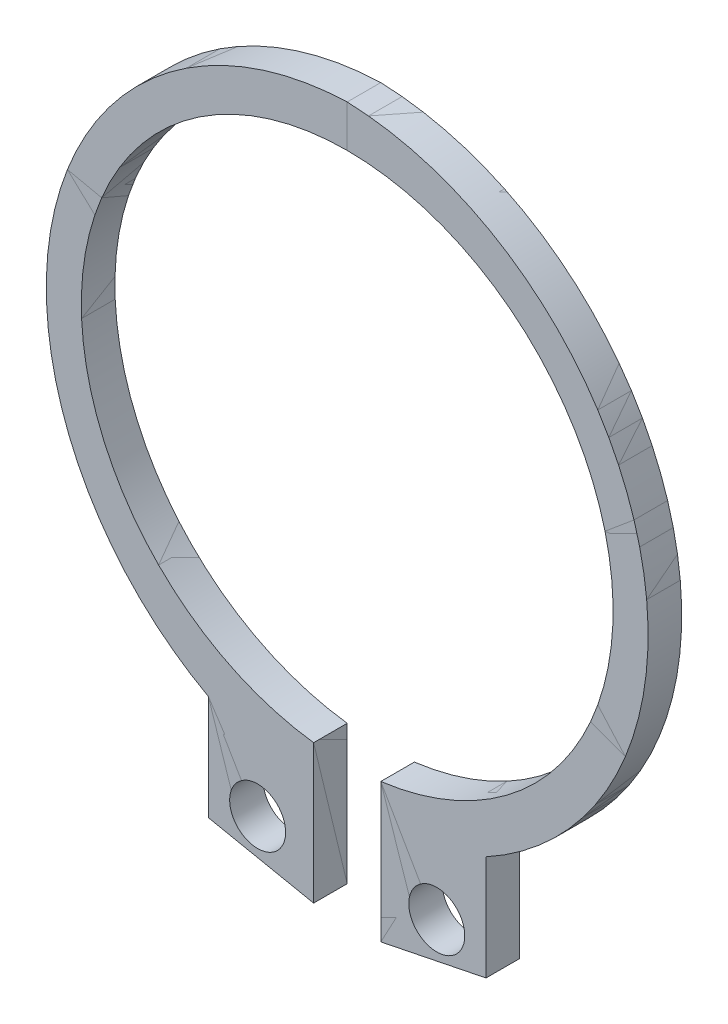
ISO-10303-21;
HEADER;
FILE_DESCRIPTION(('STEP AP214'),'2;1');
FILE_NAME('part.step','',(''),(''),'','','');
FILE_SCHEMA(('AUTOMOTIVE_DESIGN { 1 0 10303 214 1 1 1 1 }'));
ENDSEC;
DATA;
#1=APPLICATION_CONTEXT('core data for automotive mechanical design processes');
#2=APPLICATION_PROTOCOL_DEFINITION('international standard','automotive_design',2000,#1);
#3=PRODUCT_CONTEXT('',#1,'mechanical');
#4=PRODUCT('Part','Part','',(#3));
#5=PRODUCT_RELATED_PRODUCT_CATEGORY('part','',(#4));
#6=PRODUCT_DEFINITION_FORMATION('','',#4);
#7=PRODUCT_DEFINITION_CONTEXT('part definition',#1,'design');
#8=PRODUCT_DEFINITION('design','',#6,#7);
#9=PRODUCT_DEFINITION_SHAPE('','',#8);
#10=(LENGTH_UNIT() NAMED_UNIT(*) SI_UNIT(.MILLI.,.METRE.));
#11=(NAMED_UNIT(*) PLANE_ANGLE_UNIT() SI_UNIT($,.RADIAN.));
#12=(NAMED_UNIT(*) SI_UNIT($,.STERADIAN.) SOLID_ANGLE_UNIT());
#13=UNCERTAINTY_MEASURE_WITH_UNIT(LENGTH_MEASURE(1.E-05),#10,'distance_accuracy_value','');
#14=(GEOMETRIC_REPRESENTATION_CONTEXT(3) GLOBAL_UNCERTAINTY_ASSIGNED_CONTEXT((#13)) GLOBAL_UNIT_ASSIGNED_CONTEXT((#10,
#11,#12)) REPRESENTATION_CONTEXT('',''));
#15=CARTESIAN_POINT('',(0.,0.,0.));
#16=DIRECTION('',(0.,0.,1.));
#17=DIRECTION('',(1.,0.,0.));
#18=AXIS2_PLACEMENT_3D('',#15,#16,#17);
#19=CARTESIAN_POINT('',(-4.95929207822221,-13.6255430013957,1.2));
#20=DIRECTION('',(0.198862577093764,0.980027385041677,0.));
#21=DIRECTION('',(-0.980027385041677,0.198862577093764,0.));
#22=AXIS2_PLACEMENT_3D('',#19,#20,#21);
#23=PLANE('',#22);
#24=DIRECTION('',(0.980027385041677,-0.198862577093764,0.));
#25=VECTOR('',#24,1.);
#26=CARTESIAN_POINT('',(-4.95929207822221,-13.6255430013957,0.));
#27=LINE('',#26,#25);
#28=CARTESIAN_POINT('',(-4.95929207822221,-13.6255430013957,0.));
#29=VERTEX_POINT('',#28);
#30=CARTESIAN_POINT('',(-1.20000000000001,-14.3883609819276,0.));
#31=VERTEX_POINT('',#30);
#32=EDGE_CURVE('P0_E464',#29,#31,#27,.T.);
#33=ORIENTED_EDGE('',*,*,#32,.T.);
#34=DIRECTION('',(0.,0.,1.));
#35=VECTOR('',#34,1.);
#36=CARTESIAN_POINT('',(-1.20000000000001,-14.3883609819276,1.2));
#37=LINE('',#36,#35);
#38=CARTESIAN_POINT('',(-1.20000000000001,-14.3883609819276,1.2));
#39=VERTEX_POINT('',#38);
#40=EDGE_CURVE('P0_E369',#31,#39,#37,.T.);
#41=ORIENTED_EDGE('',*,*,#40,.T.);
#42=DIRECTION('',(0.980027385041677,-0.198862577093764,0.));
#43=VECTOR('',#42,1.);
#44=CARTESIAN_POINT('',(-4.95929207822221,-13.6255430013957,1.2));
#45=LINE('',#44,#43);
#46=CARTESIAN_POINT('',(-4.95929207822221,-13.6255430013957,1.2));
#47=VERTEX_POINT('',#46);
#48=EDGE_CURVE('P0_E470',#47,#39,#45,.T.);
#49=ORIENTED_EDGE('',*,*,#48,.F.);
#50=DIRECTION('',(0.,0.,-1.));
#51=VECTOR('',#50,1.);
#52=CARTESIAN_POINT('',(-4.95929207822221,-13.6255430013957,1.2));
#53=LINE('',#52,#51);
#54=EDGE_CURVE('P0_E356',#47,#29,#53,.T.);
#55=ORIENTED_EDGE('',*,*,#54,.T.);
#56=EDGE_LOOP('',(#33,#41,#49,#55));
#57=FACE_BOUND('',#56,.T.);
#58=ADVANCED_FACE('P0_F353',(#57),#23,.F.);
#59=CARTESIAN_POINT('',(0.,0.,1.2));
#60=DIRECTION('',(0.,0.,-1.));
#61=DIRECTION('',(-1.,0.,0.));
#62=AXIS2_PLACEMENT_3D('',#59,#60,#61);
#63=CYLINDRICAL_SURFACE('',#62,9.5);
#64=DIRECTION('',(0.,0.,-1.));
#65=VECTOR('',#64,1.);
#66=CARTESIAN_POINT('',(-1.20000000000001,-9.42390577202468,1.2));
#67=LINE('',#66,#65);
#68=CARTESIAN_POINT('',(-1.20000000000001,-9.42390577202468,0.));
#69=VERTEX_POINT('',#68);
#70=CARTESIAN_POINT('',(-1.20000000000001,-9.42390577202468,1.2));
#71=VERTEX_POINT('',#70);
#72=EDGE_CURVE('P0_E447',#69,#71,#67,.F.);
#73=ORIENTED_EDGE('',*,*,#72,.F.);
#74=CARTESIAN_POINT('',(0.,0.,0.));
#75=DIRECTION('',(0.,0.,1.));
#76=DIRECTION('',(0.,1.,0.));
#77=AXIS2_PLACEMENT_3D('',#74,#75,#76);
#78=CIRCLE('',#77,9.5);
#79=CARTESIAN_POINT('',(0.,9.5,0.));
#80=VERTEX_POINT('',#79);
#81=EDGE_CURVE('P0_E477',#80,#69,#78,.T.);
#82=ORIENTED_EDGE('',*,*,#81,.F.);
#83=DIRECTION('',(0.,0.,-1.));
#84=VECTOR('',#83,1.);
#85=CARTESIAN_POINT('',(0.,9.5,1.2));
#86=LINE('',#85,#84);
#87=CARTESIAN_POINT('',(0.,9.5,1.2));
#88=VERTEX_POINT('',#87);
#89=EDGE_CURVE('P0_E11',#88,#80,#86,.T.);
#90=ORIENTED_EDGE('',*,*,#89,.F.);
#91=CARTESIAN_POINT('',(0.,0.,1.2));
#92=DIRECTION('',(0.,0.,1.));
#93=DIRECTION('',(0.,1.,0.));
#94=AXIS2_PLACEMENT_3D('',#91,#92,#93);
#95=CIRCLE('',#94,9.5);
#96=EDGE_CURVE('P0_E490',#88,#71,#95,.T.);
#97=ORIENTED_EDGE('',*,*,#96,.T.);
#98=EDGE_LOOP('',(#73,#82,#90,#97));
#99=FACE_BOUND('',#98,.T.);
#100=ADVANCED_FACE('P0_F518',(#99),#63,.F.);
#101=CARTESIAN_POINT('',(0.370425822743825,-0.114847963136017,1.2));
#102=DIRECTION('',(0.,0.,-1.));
#103=DIRECTION('',(-1.,0.,0.));
#104=AXIS2_PLACEMENT_3D('',#101,#102,#103);
#105=CYLINDRICAL_SURFACE('',#104,11.1210188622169);
#106=CARTESIAN_POINT('',(0.370425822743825,-0.114847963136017,0.));
#107=DIRECTION('',(0.,0.,1.));
#108=DIRECTION('',(0.,1.,0.));
#109=AXIS2_PLACEMENT_3D('',#106,#107,#108);
#110=CIRCLE('',#109,11.1210188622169);
#111=CARTESIAN_POINT('',(0.,11.,0.));
#112=VERTEX_POINT('',#111);
#113=CARTESIAN_POINT('',(-4.95929207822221,-9.87554300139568,0.));
#114=VERTEX_POINT('',#113);
#115=EDGE_CURVE('P0_E471',#112,#114,#110,.T.);
#116=ORIENTED_EDGE('',*,*,#115,.T.);
#117=DIRECTION('',(0.,0.,-1.));
#118=VECTOR('',#117,1.);
#119=CARTESIAN_POINT('',(-4.95929207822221,-9.87554300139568,1.2));
#120=LINE('',#119,#118);
#121=CARTESIAN_POINT('',(-4.95929207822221,-9.87554300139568,1.2));
#122=VERTEX_POINT('',#121);
#123=EDGE_CURVE('P0_E496',#122,#114,#120,.T.);
#124=ORIENTED_EDGE('',*,*,#123,.F.);
#125=CARTESIAN_POINT('',(0.370425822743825,-0.114847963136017,1.2));
#126=DIRECTION('',(0.,0.,1.));
#127=DIRECTION('',(0.,1.,0.));
#128=AXIS2_PLACEMENT_3D('',#125,#126,#127);
#129=CIRCLE('',#128,11.1210188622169);
#130=CARTESIAN_POINT('',(0.,11.,1.2));
#131=VERTEX_POINT('',#130);
#132=EDGE_CURVE('P0_E485',#131,#122,#129,.T.);
#133=ORIENTED_EDGE('',*,*,#132,.F.);
#134=DIRECTION('',(0.,0.,-1.));
#135=VECTOR('',#134,1.);
#136=CARTESIAN_POINT('',(0.,11.,1.2));
#137=LINE('',#136,#135);
#138=EDGE_CURVE('P0_E361',#131,#112,#137,.T.);
#139=ORIENTED_EDGE('',*,*,#138,.T.);
#140=EDGE_LOOP('',(#116,#124,#133,#139));
#141=FACE_BOUND('',#140,.T.);
#142=ADVANCED_FACE('P0_F510',(#141),#105,.T.);
#143=CARTESIAN_POINT('',(-4.95929207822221,-13.6255430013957,1.2));
#144=DIRECTION('',(-1.,0.,0.));
#145=DIRECTION('',(0.,0.,1.));
#146=AXIS2_PLACEMENT_3D('',#143,#144,#145);
#147=PLANE('',#146);
#148=DIRECTION('',(0.,1.,0.));
#149=VECTOR('',#148,1.);
#150=CARTESIAN_POINT('',(-4.95929207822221,-13.6255430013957,0.));
#151=LINE('',#150,#149);
#152=EDGE_CURVE('P0_E467',#29,#114,#151,.T.);
#153=ORIENTED_EDGE('',*,*,#152,.F.);
#154=ORIENTED_EDGE('',*,*,#54,.F.);
#155=DIRECTION('',(0.,1.,0.));
#156=VECTOR('',#155,1.);
#157=CARTESIAN_POINT('',(-4.95929207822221,-13.6255430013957,1.2));
#158=LINE('',#157,#156);
#159=EDGE_CURVE('P0_E482',#47,#122,#158,.T.);
#160=ORIENTED_EDGE('',*,*,#159,.T.);
#161=ORIENTED_EDGE('',*,*,#123,.T.);
#162=EDGE_LOOP('',(#153,#154,#160,#161));
#163=FACE_BOUND('',#162,.T.);
#164=ADVANCED_FACE('P0_F507',(#163),#147,.T.);
#165=CARTESIAN_POINT('',(0.,0.,1.2));
#166=DIRECTION('',(0.,0.,1.));
#167=DIRECTION('',(1.,0.,0.));
#168=AXIS2_PLACEMENT_3D('',#165,#166,#167);
#169=PLANE('',#168);
#170=CARTESIAN_POINT('',(-3.20000000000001,-12.7,1.2));
#171=DIRECTION('',(0.,0.,-1.));
#172=DIRECTION('',(0.,1.,0.));
#173=AXIS2_PLACEMENT_3D('',#170,#171,#172);
#174=CIRCLE('',#173,1.);
#175=CARTESIAN_POINT('',(-3.20000000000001,-11.7,1.2));
#176=VERTEX_POINT('',#175);
#177=EDGE_CURVE('P0_E597',#176,#176,#174,.T.);
#178=ORIENTED_EDGE('',*,*,#177,.T.);
#179=EDGE_LOOP('',(#178));
#180=FACE_BOUND('',#179,.T.);
#181=DIRECTION('',(0.,1.,0.));
#182=VECTOR('',#181,1.);
#183=CARTESIAN_POINT('',(-1.20000000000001,-8.45,1.2));
#184=LINE('',#183,#182);
#185=EDGE_CURVE('P0_E554',#39,#71,#184,.T.);
#186=ORIENTED_EDGE('',*,*,#185,.T.);
#187=ORIENTED_EDGE('',*,*,#96,.F.);
#188=DIRECTION('',(0.,-1.,0.));
#189=VECTOR('',#188,1.);
#190=CARTESIAN_POINT('',(0.,11.,1.2));
#191=LINE('',#190,#189);
#192=EDGE_CURVE('P0_E487',#131,#88,#191,.T.);
#193=ORIENTED_EDGE('',*,*,#192,.F.);
#194=ORIENTED_EDGE('',*,*,#132,.T.);
#195=ORIENTED_EDGE('',*,*,#159,.F.);
#196=ORIENTED_EDGE('',*,*,#48,.T.);
#197=EDGE_LOOP('',(#186,#187,#193,#194,#195,#196));
#198=FACE_BOUND('',#197,.T.);
#199=ADVANCED_FACE('P0_F509',(#180,#198),#169,.T.);
#200=CARTESIAN_POINT('',(0.,0.,0.));
#201=DIRECTION('',(0.,0.,1.));
#202=DIRECTION('',(1.,0.,0.));
#203=AXIS2_PLACEMENT_3D('',#200,#201,#202);
#204=PLANE('',#203);
#205=CARTESIAN_POINT('',(-3.20000000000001,-12.7,0.));
#206=DIRECTION('',(0.,0.,1.));
#207=DIRECTION('',(0.,1.,0.));
#208=AXIS2_PLACEMENT_3D('',#205,#206,#207);
#209=CIRCLE('',#208,1.);
#210=CARTESIAN_POINT('',(-3.20000000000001,-11.7,0.));
#211=VERTEX_POINT('',#210);
#212=EDGE_CURVE('P0_E595',#211,#211,#209,.T.);
#213=ORIENTED_EDGE('',*,*,#212,.T.);
#214=EDGE_LOOP('',(#213));
#215=FACE_BOUND('',#214,.T.);
#216=ORIENTED_EDGE('',*,*,#81,.T.);
#217=DIRECTION('',(0.,-1.,0.));
#218=VECTOR('',#217,1.);
#219=CARTESIAN_POINT('',(-1.20000000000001,-8.45,0.));
#220=LINE('',#219,#218);
#221=EDGE_CURVE('P0_E437',#69,#31,#220,.T.);
#222=ORIENTED_EDGE('',*,*,#221,.T.);
#223=ORIENTED_EDGE('',*,*,#32,.F.);
#224=ORIENTED_EDGE('',*,*,#152,.T.);
#225=ORIENTED_EDGE('',*,*,#115,.F.);
#226=DIRECTION('',(0.,-1.,0.));
#227=VECTOR('',#226,1.);
#228=CARTESIAN_POINT('',(0.,11.,0.));
#229=LINE('',#228,#227);
#230=EDGE_CURVE('P0_E474',#112,#80,#229,.T.);
#231=ORIENTED_EDGE('',*,*,#230,.T.);
#232=EDGE_LOOP('',(#216,#222,#223,#224,#225,#231));
#233=FACE_BOUND('',#232,.T.);
#234=ADVANCED_FACE('P0_F505',(#215,#233),#204,.F.);
#235=CARTESIAN_POINT('',(4.95929207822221,-13.6255430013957,0.));
#236=DIRECTION('',(-0.198862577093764,0.980027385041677,0.));
#237=DIRECTION('',(0.980027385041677,0.198862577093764,0.));
#238=AXIS2_PLACEMENT_3D('',#235,#236,#237);
#239=PLANE('',#238);
#240=DIRECTION('',(-0.980027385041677,-0.198862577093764,0.));
#241=VECTOR('',#240,1.);
#242=CARTESIAN_POINT('',(4.95929207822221,-13.6255430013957,1.2));
#243=LINE('',#242,#241);
#244=CARTESIAN_POINT('',(4.95929207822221,-13.6255430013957,1.2));
#245=VERTEX_POINT('',#244);
#246=CARTESIAN_POINT('',(1.20000000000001,-14.3883609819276,1.2));
#247=VERTEX_POINT('',#246);
#248=EDGE_CURVE('P0_E446',#245,#247,#243,.T.);
#249=ORIENTED_EDGE('',*,*,#248,.T.);
#250=DIRECTION('',(0.,0.,-1.));
#251=VECTOR('',#250,1.);
#252=CARTESIAN_POINT('',(1.20000000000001,-14.3883609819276,0.));
#253=LINE('',#252,#251);
#254=CARTESIAN_POINT('',(1.20000000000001,-14.3883609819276,0.));
#255=VERTEX_POINT('',#254);
#256=EDGE_CURVE('P0_E377',#247,#255,#253,.T.);
#257=ORIENTED_EDGE('',*,*,#256,.T.);
#258=DIRECTION('',(-0.980027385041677,-0.198862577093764,0.));
#259=VECTOR('',#258,1.);
#260=CARTESIAN_POINT('',(4.95929207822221,-13.6255430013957,0.));
#261=LINE('',#260,#259);
#262=CARTESIAN_POINT('',(4.95929207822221,-13.6255430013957,0.));
#263=VERTEX_POINT('',#262);
#264=EDGE_CURVE('P0_E443',#263,#255,#261,.T.);
#265=ORIENTED_EDGE('',*,*,#264,.F.);
#266=DIRECTION('',(0.,0.,1.));
#267=VECTOR('',#266,1.);
#268=CARTESIAN_POINT('',(4.95929207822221,-13.6255430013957,0.));
#269=LINE('',#268,#267);
#270=EDGE_CURVE('P0_E465',#263,#245,#269,.T.);
#271=ORIENTED_EDGE('',*,*,#270,.T.);
#272=EDGE_LOOP('',(#249,#257,#265,#271));
#273=FACE_BOUND('',#272,.T.);
#274=ADVANCED_FACE('P0_F442',(#273),#239,.F.);
#275=CARTESIAN_POINT('',(0.,0.,0.));
#276=DIRECTION('',(0.,0.,1.));
#277=DIRECTION('',(1.,0.,0.));
#278=AXIS2_PLACEMENT_3D('',#275,#276,#277);
#279=CYLINDRICAL_SURFACE('',#278,9.5);
#280=DIRECTION('',(0.,0.,1.));
#281=VECTOR('',#280,1.);
#282=CARTESIAN_POINT('',(1.20000000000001,-9.42390577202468,0.));
#283=LINE('',#282,#281);
#284=CARTESIAN_POINT('',(1.20000000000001,-9.42390577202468,1.2));
#285=VERTEX_POINT('',#284);
#286=CARTESIAN_POINT('',(1.20000000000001,-9.42390577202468,0.));
#287=VERTEX_POINT('',#286);
#288=EDGE_CURVE('P0_E432',#285,#287,#283,.F.);
#289=ORIENTED_EDGE('',*,*,#288,.F.);
#290=CARTESIAN_POINT('',(0.,0.,1.2));
#291=DIRECTION('',(0.,0.,-1.));
#292=DIRECTION('',(0.,1.,0.));
#293=AXIS2_PLACEMENT_3D('',#290,#291,#292);
#294=CIRCLE('',#293,9.5);
#295=EDGE_CURVE('P0_E546',#88,#285,#294,.T.);
#296=ORIENTED_EDGE('',*,*,#295,.F.);
#297=ORIENTED_EDGE('',*,*,#89,.T.);
#298=CARTESIAN_POINT('',(0.,0.,0.));
#299=DIRECTION('',(0.,0.,-1.));
#300=DIRECTION('',(0.,1.,0.));
#301=AXIS2_PLACEMENT_3D('',#298,#299,#300);
#302=CIRCLE('',#301,9.5);
#303=EDGE_CURVE('P0_E452',#80,#287,#302,.T.);
#304=ORIENTED_EDGE('',*,*,#303,.T.);
#305=EDGE_LOOP('',(#289,#296,#297,#304));
#306=FACE_BOUND('',#305,.T.);
#307=ADVANCED_FACE('P0_F583',(#306),#279,.F.);
#308=CARTESIAN_POINT('',(-0.370425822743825,-0.114847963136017,0.));
#309=DIRECTION('',(0.,0.,1.));
#310=DIRECTION('',(1.,0.,0.));
#311=AXIS2_PLACEMENT_3D('',#308,#309,#310);
#312=CYLINDRICAL_SURFACE('',#311,11.1210188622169);
#313=CARTESIAN_POINT('',(-0.370425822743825,-0.114847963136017,1.2));
#314=DIRECTION('',(0.,0.,-1.));
#315=DIRECTION('',(0.,1.,0.));
#316=AXIS2_PLACEMENT_3D('',#313,#314,#315);
#317=CIRCLE('',#316,11.1210188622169);
#318=CARTESIAN_POINT('',(4.95929207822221,-9.87554300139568,1.2));
#319=VERTEX_POINT('',#318);
#320=EDGE_CURVE('P0_E458',#131,#319,#317,.T.);
#321=ORIENTED_EDGE('',*,*,#320,.T.);
#322=DIRECTION('',(0.,0.,1.));
#323=VECTOR('',#322,1.);
#324=CARTESIAN_POINT('',(4.95929207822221,-9.87554300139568,0.));
#325=LINE('',#324,#323);
#326=CARTESIAN_POINT('',(4.95929207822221,-9.87554300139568,0.));
#327=VERTEX_POINT('',#326);
#328=EDGE_CURVE('P0_E462',#327,#319,#325,.T.);
#329=ORIENTED_EDGE('',*,*,#328,.F.);
#330=CARTESIAN_POINT('',(-0.370425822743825,-0.114847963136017,0.));
#331=DIRECTION('',(0.,0.,-1.));
#332=DIRECTION('',(0.,1.,0.));
#333=AXIS2_PLACEMENT_3D('',#330,#331,#332);
#334=CIRCLE('',#333,11.1210188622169);
#335=EDGE_CURVE('P0_E455',#112,#327,#334,.T.);
#336=ORIENTED_EDGE('',*,*,#335,.F.);
#337=ORIENTED_EDGE('',*,*,#138,.F.);
#338=EDGE_LOOP('',(#321,#329,#336,#337));
#339=FACE_BOUND('',#338,.T.);
#340=ADVANCED_FACE('P0_F541',(#339),#312,.T.);
#341=CARTESIAN_POINT('',(4.95929207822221,-13.6255430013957,0.));
#342=DIRECTION('',(1.,0.,0.));
#343=DIRECTION('',(0.,0.,-1.));
#344=AXIS2_PLACEMENT_3D('',#341,#342,#343);
#345=PLANE('',#344);
#346=DIRECTION('',(0.,1.,0.));
#347=VECTOR('',#346,1.);
#348=CARTESIAN_POINT('',(4.95929207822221,-13.6255430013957,1.2));
#349=LINE('',#348,#347);
#350=EDGE_CURVE('P0_E453',#245,#319,#349,.T.);
#351=ORIENTED_EDGE('',*,*,#350,.F.);
#352=ORIENTED_EDGE('',*,*,#270,.F.);
#353=DIRECTION('',(0.,1.,0.));
#354=VECTOR('',#353,1.);
#355=CARTESIAN_POINT('',(4.95929207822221,-13.6255430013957,0.));
#356=LINE('',#355,#354);
#357=EDGE_CURVE('P0_E451',#263,#327,#356,.T.);
#358=ORIENTED_EDGE('',*,*,#357,.T.);
#359=ORIENTED_EDGE('',*,*,#328,.T.);
#360=EDGE_LOOP('',(#351,#352,#358,#359));
#361=FACE_BOUND('',#360,.T.);
#362=ADVANCED_FACE('P0_F553',(#361),#345,.T.);
#363=CARTESIAN_POINT('',(0.,0.,0.));
#364=DIRECTION('',(0.,0.,-1.));
#365=DIRECTION('',(-1.,0.,0.));
#366=AXIS2_PLACEMENT_3D('',#363,#364,#365);
#367=PLANE('',#366);
#368=CARTESIAN_POINT('',(3.20000000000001,-12.7,0.));
#369=DIRECTION('',(0.,0.,1.));
#370=DIRECTION('',(0.,1.,0.));
#371=AXIS2_PLACEMENT_3D('',#368,#369,#370);
#372=CIRCLE('',#371,1.);
#373=CARTESIAN_POINT('',(3.20000000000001,-11.7,0.));
#374=VERTEX_POINT('',#373);
#375=EDGE_CURVE('P0_E603',#374,#374,#372,.T.);
#376=ORIENTED_EDGE('',*,*,#375,.T.);
#377=EDGE_LOOP('',(#376));
#378=FACE_BOUND('',#377,.T.);
#379=DIRECTION('',(0.,1.,0.));
#380=VECTOR('',#379,1.);
#381=CARTESIAN_POINT('',(1.20000000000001,-8.45,0.));
#382=LINE('',#381,#380);
#383=EDGE_CURVE('P0_E429',#255,#287,#382,.T.);
#384=ORIENTED_EDGE('',*,*,#383,.T.);
#385=ORIENTED_EDGE('',*,*,#303,.F.);
#386=ORIENTED_EDGE('',*,*,#230,.F.);
#387=ORIENTED_EDGE('',*,*,#335,.T.);
#388=ORIENTED_EDGE('',*,*,#357,.F.);
#389=ORIENTED_EDGE('',*,*,#264,.T.);
#390=EDGE_LOOP('',(#384,#385,#386,#387,#388,#389));
#391=FACE_BOUND('',#390,.T.);
#392=ADVANCED_FACE('P0_F449',(#378,#391),#367,.T.);
#393=CARTESIAN_POINT('',(0.,0.,1.2));
#394=DIRECTION('',(0.,0.,-1.));
#395=DIRECTION('',(-1.,0.,0.));
#396=AXIS2_PLACEMENT_3D('',#393,#394,#395);
#397=PLANE('',#396);
#398=CARTESIAN_POINT('',(3.20000000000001,-12.7,1.2));
#399=DIRECTION('',(0.,0.,-1.));
#400=DIRECTION('',(0.,1.,0.));
#401=AXIS2_PLACEMENT_3D('',#398,#399,#400);
#402=CIRCLE('',#401,1.);
#403=CARTESIAN_POINT('',(3.20000000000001,-11.7,1.2));
#404=VERTEX_POINT('',#403);
#405=EDGE_CURVE('P0_E598',#404,#404,#402,.T.);
#406=ORIENTED_EDGE('',*,*,#405,.T.);
#407=EDGE_LOOP('',(#406));
#408=FACE_BOUND('',#407,.T.);
#409=ORIENTED_EDGE('',*,*,#295,.T.);
#410=DIRECTION('',(0.,-1.,0.));
#411=VECTOR('',#410,1.);
#412=CARTESIAN_POINT('',(1.20000000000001,-8.45,1.2));
#413=LINE('',#412,#411);
#414=EDGE_CURVE('P0_E436',#285,#247,#413,.T.);
#415=ORIENTED_EDGE('',*,*,#414,.T.);
#416=ORIENTED_EDGE('',*,*,#248,.F.);
#417=ORIENTED_EDGE('',*,*,#350,.T.);
#418=ORIENTED_EDGE('',*,*,#320,.F.);
#419=ORIENTED_EDGE('',*,*,#192,.T.);
#420=EDGE_LOOP('',(#409,#415,#416,#417,#418,#419));
#421=FACE_BOUND('',#420,.T.);
#422=ADVANCED_FACE('P0_F544',(#408,#421),#397,.F.);
#423=CARTESIAN_POINT('',(1.20000000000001,-8.45,0.));
#424=DIRECTION('',(1.,0.,0.));
#425=DIRECTION('',(0.,0.,-1.));
#426=AXIS2_PLACEMENT_3D('',#423,#424,#425);
#427=PLANE('',#426);
#428=ORIENTED_EDGE('',*,*,#414,.F.);
#429=ORIENTED_EDGE('',*,*,#288,.T.);
#430=ORIENTED_EDGE('',*,*,#383,.F.);
#431=ORIENTED_EDGE('',*,*,#256,.F.);
#432=EDGE_LOOP('',(#428,#429,#430,#431));
#433=FACE_BOUND('',#432,.T.);
#434=ADVANCED_FACE('P0_F430',(#433),#427,.F.);
#435=CARTESIAN_POINT('',(-1.20000000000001,-8.45,0.));
#436=DIRECTION('',(-1.,0.,0.));
#437=DIRECTION('',(0.,0.,1.));
#438=AXIS2_PLACEMENT_3D('',#435,#436,#437);
#439=PLANE('',#438);
#440=ORIENTED_EDGE('',*,*,#221,.F.);
#441=ORIENTED_EDGE('',*,*,#72,.T.);
#442=ORIENTED_EDGE('',*,*,#185,.F.);
#443=ORIENTED_EDGE('',*,*,#40,.F.);
#444=EDGE_LOOP('',(#440,#441,#442,#443));
#445=FACE_BOUND('',#444,.T.);
#446=ADVANCED_FACE('P0_F560',(#445),#439,.F.);
#447=CARTESIAN_POINT('',(-3.20000000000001,-12.7,0.));
#448=DIRECTION('',(0.,0.,1.));
#449=DIRECTION('',(0.,1.,0.));
#450=AXIS2_PLACEMENT_3D('',#447,#448,#449);
#451=CYLINDRICAL_SURFACE('',#450,1.);
#452=ORIENTED_EDGE('',*,*,#177,.F.);
#453=EDGE_LOOP('',(#452));
#454=FACE_BOUND('',#453,.T.);
#455=ORIENTED_EDGE('',*,*,#212,.F.);
#456=EDGE_LOOP('',(#455));
#457=FACE_BOUND('',#456,.T.);
#458=ADVANCED_FACE('P0_F562',(#454,#457),#451,.F.);
#459=CARTESIAN_POINT('',(3.20000000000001,-12.7,0.));
#460=DIRECTION('',(0.,0.,1.));
#461=DIRECTION('',(0.,1.,0.));
#462=AXIS2_PLACEMENT_3D('',#459,#460,#461);
#463=CYLINDRICAL_SURFACE('',#462,1.);
#464=ORIENTED_EDGE('',*,*,#405,.F.);
#465=EDGE_LOOP('',(#464));
#466=FACE_BOUND('',#465,.T.);
#467=ORIENTED_EDGE('',*,*,#375,.F.);
#468=EDGE_LOOP('',(#467));
#469=FACE_BOUND('',#468,.T.);
#470=ADVANCED_FACE('P0_F568',(#466,#469),#463,.F.);
#471=CLOSED_SHELL('',(#58,#100,#142,#164,#199,#234,#274,#307,#340,#362,#392,#422,#434,#446,#458,#470));
#472=MANIFOLD_SOLID_BREP('P0_B2',#471);
#473=CARTESIAN_POINT('',(-4.9592920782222,-13.6255430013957,1.2));
#474=DIRECTION('',(0.198862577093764,0.980027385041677,0.));
#475=DIRECTION('',(-0.980027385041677,0.198862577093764,0.));
#476=AXIS2_PLACEMENT_3D('',#473,#474,#475);
#477=PLANE('',#476);
#478=DIRECTION('',(0.980027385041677,-0.198862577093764,0.));
#479=VECTOR('',#478,1.);
#480=CARTESIAN_POINT('',(-4.9592920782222,-13.6255430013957,0.));
#481=LINE('',#480,#479);
#482=CARTESIAN_POINT('',(-4.9592920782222,-13.6255430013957,0.));
#483=VERTEX_POINT('',#482);
#484=CARTESIAN_POINT('',(-1.2,-14.3883609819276,0.));
#485=VERTEX_POINT('',#484);
#486=EDGE_CURVE('P1_E126',#483,#485,#481,.T.);
#487=ORIENTED_EDGE('',*,*,#486,.T.);
#488=DIRECTION('',(0.,0.,1.));
#489=VECTOR('',#488,1.);
#490=CARTESIAN_POINT('',(-1.2,-14.3883609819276,1.2));
#491=LINE('',#490,#489);
#492=CARTESIAN_POINT('',(-1.2,-14.3883609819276,1.2));
#493=VERTEX_POINT('',#492);
#494=EDGE_CURVE('P1_E31',#485,#493,#491,.T.);
#495=ORIENTED_EDGE('',*,*,#494,.T.);
#496=DIRECTION('',(0.980027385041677,-0.198862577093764,0.));
#497=VECTOR('',#496,1.);
#498=CARTESIAN_POINT('',(-4.9592920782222,-13.6255430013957,1.2));
#499=LINE('',#498,#497);
#500=CARTESIAN_POINT('',(-4.9592920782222,-13.6255430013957,1.2));
#501=VERTEX_POINT('',#500);
#502=EDGE_CURVE('P1_E132',#501,#493,#499,.T.);
#503=ORIENTED_EDGE('',*,*,#502,.F.);
#504=DIRECTION('',(0.,0.,-1.));
#505=VECTOR('',#504,1.);
#506=CARTESIAN_POINT('',(-4.9592920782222,-13.6255430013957,1.2));
#507=LINE('',#506,#505);
#508=EDGE_CURVE('P1_E18',#501,#483,#507,.T.);
#509=ORIENTED_EDGE('',*,*,#508,.T.);
#510=EDGE_LOOP('',(#487,#495,#503,#509));
#511=FACE_BOUND('',#510,.T.);
#512=ADVANCED_FACE('P1_F15',(#511),#477,.F.);
#513=CARTESIAN_POINT('',(0.,0.,1.2));
#514=DIRECTION('',(0.,0.,-1.));
#515=DIRECTION('',(-1.,0.,0.));
#516=AXIS2_PLACEMENT_3D('',#513,#514,#515);
#517=CYLINDRICAL_SURFACE('',#516,9.5);
#518=DIRECTION('',(0.,0.,-1.));
#519=VECTOR('',#518,1.);
#520=CARTESIAN_POINT('',(-1.2,-9.42390577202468,1.2));
#521=LINE('',#520,#519);
#522=CARTESIAN_POINT('',(-1.2,-9.42390577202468,0.));
#523=VERTEX_POINT('',#522);
#524=CARTESIAN_POINT('',(-1.2,-9.42390577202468,1.2));
#525=VERTEX_POINT('',#524);
#526=EDGE_CURVE('P1_E109',#523,#525,#521,.F.);
#527=ORIENTED_EDGE('',*,*,#526,.F.);
#528=CARTESIAN_POINT('',(0.,0.,0.));
#529=DIRECTION('',(0.,0.,1.));
#530=DIRECTION('',(0.,1.,0.));
#531=AXIS2_PLACEMENT_3D('',#528,#529,#530);
#532=CIRCLE('',#531,9.5);
#533=CARTESIAN_POINT('',(0.,9.5,0.));
#534=VERTEX_POINT('',#533);
#535=EDGE_CURVE('P1_E139',#534,#523,#532,.T.);
#536=ORIENTED_EDGE('',*,*,#535,.F.);
#537=DIRECTION('',(0.,0.,-1.));
#538=VECTOR('',#537,1.);
#539=CARTESIAN_POINT('',(0.,9.5,1.2));
#540=LINE('',#539,#538);
#541=CARTESIAN_POINT('',(0.,9.5,1.2));
#542=VERTEX_POINT('',#541);
#543=EDGE_CURVE('P1_E10',#542,#534,#540,.T.);
#544=ORIENTED_EDGE('',*,*,#543,.F.);
#545=CARTESIAN_POINT('',(0.,0.,1.2));
#546=DIRECTION('',(0.,0.,1.));
#547=DIRECTION('',(0.,1.,0.));
#548=AXIS2_PLACEMENT_3D('',#545,#546,#547);
#549=CIRCLE('',#548,9.5);
#550=EDGE_CURVE('P1_E152',#542,#525,#549,.T.);
#551=ORIENTED_EDGE('',*,*,#550,.T.);
#552=EDGE_LOOP('',(#527,#536,#544,#551));
#553=FACE_BOUND('',#552,.T.);
#554=ADVANCED_FACE('P1_F180',(#553),#517,.F.);
#555=CARTESIAN_POINT('',(0.370425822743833,-0.114847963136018,1.2));
#556=DIRECTION('',(0.,0.,-1.));
#557=DIRECTION('',(-1.,0.,0.));
#558=AXIS2_PLACEMENT_3D('',#555,#556,#557);
#559=CYLINDRICAL_SURFACE('',#558,11.1210188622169);
#560=CARTESIAN_POINT('',(0.370425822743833,-0.114847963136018,0.));
#561=DIRECTION('',(0.,0.,1.));
#562=DIRECTION('',(0.,1.,0.));
#563=AXIS2_PLACEMENT_3D('',#560,#561,#562);
#564=CIRCLE('',#563,11.1210188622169);
#565=CARTESIAN_POINT('',(0.,11.,0.));
#566=VERTEX_POINT('',#565);
#567=CARTESIAN_POINT('',(-4.9592920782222,-9.87554300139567,0.));
#568=VERTEX_POINT('',#567);
#569=EDGE_CURVE('P1_E133',#566,#568,#564,.T.);
#570=ORIENTED_EDGE('',*,*,#569,.T.);
#571=DIRECTION('',(0.,0.,-1.));
#572=VECTOR('',#571,1.);
#573=CARTESIAN_POINT('',(-4.9592920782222,-9.87554300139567,1.2));
#574=LINE('',#573,#572);
#575=CARTESIAN_POINT('',(-4.9592920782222,-9.87554300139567,1.2));
#576=VERTEX_POINT('',#575);
#577=EDGE_CURVE('P1_E158',#576,#568,#574,.T.);
#578=ORIENTED_EDGE('',*,*,#577,.F.);
#579=CARTESIAN_POINT('',(0.370425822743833,-0.114847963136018,1.2));
#580=DIRECTION('',(0.,0.,1.));
#581=DIRECTION('',(0.,1.,0.));
#582=AXIS2_PLACEMENT_3D('',#579,#580,#581);
#583=CIRCLE('',#582,11.1210188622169);
#584=CARTESIAN_POINT('',(0.,11.,1.2));
#585=VERTEX_POINT('',#584);
#586=EDGE_CURVE('P1_E147',#585,#576,#583,.T.);
#587=ORIENTED_EDGE('',*,*,#586,.F.);
#588=DIRECTION('',(0.,0.,-1.));
#589=VECTOR('',#588,1.);
#590=CARTESIAN_POINT('',(0.,11.,1.2));
#591=LINE('',#590,#589);
#592=EDGE_CURVE('P1_E23',#585,#566,#591,.T.);
#593=ORIENTED_EDGE('',*,*,#592,.T.);
#594=EDGE_LOOP('',(#570,#578,#587,#593));
#595=FACE_BOUND('',#594,.T.);
#596=ADVANCED_FACE('P1_F172',(#595),#559,.T.);
#597=CARTESIAN_POINT('',(-4.9592920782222,-13.6255430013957,1.2));
#598=DIRECTION('',(-1.,0.,0.));
#599=DIRECTION('',(0.,0.,1.));
#600=AXIS2_PLACEMENT_3D('',#597,#598,#599);
#601=PLANE('',#600);
#602=DIRECTION('',(0.,1.,0.));
#603=VECTOR('',#602,1.);
#604=CARTESIAN_POINT('',(-4.9592920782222,-13.6255430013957,0.));
#605=LINE('',#604,#603);
#606=EDGE_CURVE('P1_E129',#483,#568,#605,.T.);
#607=ORIENTED_EDGE('',*,*,#606,.F.);
#608=ORIENTED_EDGE('',*,*,#508,.F.);
#609=DIRECTION('',(0.,1.,0.));
#610=VECTOR('',#609,1.);
#611=CARTESIAN_POINT('',(-4.9592920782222,-13.6255430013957,1.2));
#612=LINE('',#611,#610);
#613=EDGE_CURVE('P1_E144',#501,#576,#612,.T.);
#614=ORIENTED_EDGE('',*,*,#613,.T.);
#615=ORIENTED_EDGE('',*,*,#577,.T.);
#616=EDGE_LOOP('',(#607,#608,#614,#615));
#617=FACE_BOUND('',#616,.T.);
#618=ADVANCED_FACE('P1_F169',(#617),#601,.T.);
#619=CARTESIAN_POINT('',(0.,0.,1.2));
#620=DIRECTION('',(0.,0.,1.));
#621=DIRECTION('',(1.,0.,0.));
#622=AXIS2_PLACEMENT_3D('',#619,#620,#621);
#623=PLANE('',#622);
#624=CARTESIAN_POINT('',(-3.2,-12.7,1.2));
#625=DIRECTION('',(0.,0.,-1.));
#626=DIRECTION('',(0.,1.,0.));
#627=AXIS2_PLACEMENT_3D('',#624,#625,#626);
#628=CIRCLE('',#627,1.);
#629=CARTESIAN_POINT('',(-3.2,-11.7,1.2));
#630=VERTEX_POINT('',#629);
#631=EDGE_CURVE('P1_E256',#630,#630,#628,.T.);
#632=ORIENTED_EDGE('',*,*,#631,.T.);
#633=EDGE_LOOP('',(#632));
#634=FACE_BOUND('',#633,.T.);
#635=DIRECTION('',(0.,1.,0.));
#636=VECTOR('',#635,1.);
#637=CARTESIAN_POINT('',(-1.2,-8.45,1.2));
#638=LINE('',#637,#636);
#639=EDGE_CURVE('P1_E215',#493,#525,#638,.T.);
#640=ORIENTED_EDGE('',*,*,#639,.T.);
#641=ORIENTED_EDGE('',*,*,#550,.F.);
#642=DIRECTION('',(0.,-1.,0.));
#643=VECTOR('',#642,1.);
#644=CARTESIAN_POINT('',(0.,11.,1.2));
#645=LINE('',#644,#643);
#646=EDGE_CURVE('P1_E149',#585,#542,#645,.T.);
#647=ORIENTED_EDGE('',*,*,#646,.F.);
#648=ORIENTED_EDGE('',*,*,#586,.T.);
#649=ORIENTED_EDGE('',*,*,#613,.F.);
#650=ORIENTED_EDGE('',*,*,#502,.T.);
#651=EDGE_LOOP('',(#640,#641,#647,#648,#649,#650));
#652=FACE_BOUND('',#651,.T.);
#653=ADVANCED_FACE('P1_F171',(#634,#652),#623,.T.);
#654=CARTESIAN_POINT('',(0.,0.,0.));
#655=DIRECTION('',(0.,0.,1.));
#656=DIRECTION('',(1.,0.,0.));
#657=AXIS2_PLACEMENT_3D('',#654,#655,#656);
#658=PLANE('',#657);
#659=CARTESIAN_POINT('',(-3.2,-12.7,0.));
#660=DIRECTION('',(0.,0.,1.));
#661=DIRECTION('',(0.,1.,0.));
#662=AXIS2_PLACEMENT_3D('',#659,#660,#661);
#663=CIRCLE('',#662,1.);
#664=CARTESIAN_POINT('',(-3.2,-11.7,0.));
#665=VERTEX_POINT('',#664);
#666=EDGE_CURVE('P1_E254',#665,#665,#663,.T.);
#667=ORIENTED_EDGE('',*,*,#666,.T.);
#668=EDGE_LOOP('',(#667));
#669=FACE_BOUND('',#668,.T.);
#670=ORIENTED_EDGE('',*,*,#535,.T.);
#671=DIRECTION('',(0.,-1.,0.));
#672=VECTOR('',#671,1.);
#673=CARTESIAN_POINT('',(-1.2,-8.45,0.));
#674=LINE('',#673,#672);
#675=EDGE_CURVE('P1_E99',#523,#485,#674,.T.);
#676=ORIENTED_EDGE('',*,*,#675,.T.);
#677=ORIENTED_EDGE('',*,*,#486,.F.);
#678=ORIENTED_EDGE('',*,*,#606,.T.);
#679=ORIENTED_EDGE('',*,*,#569,.F.);
#680=DIRECTION('',(0.,-1.,0.));
#681=VECTOR('',#680,1.);
#682=CARTESIAN_POINT('',(0.,11.,0.));
#683=LINE('',#682,#681);
#684=EDGE_CURVE('P1_E136',#566,#534,#683,.T.);
#685=ORIENTED_EDGE('',*,*,#684,.T.);
#686=EDGE_LOOP('',(#670,#676,#677,#678,#679,#685));
#687=FACE_BOUND('',#686,.T.);
#688=ADVANCED_FACE('P1_F167',(#669,#687),#658,.F.);
#689=CARTESIAN_POINT('',(4.9592920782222,-13.6255430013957,0.));
#690=DIRECTION('',(-0.198862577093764,0.980027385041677,0.));
#691=DIRECTION('',(0.980027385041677,0.198862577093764,0.));
#692=AXIS2_PLACEMENT_3D('',#689,#690,#691);
#693=PLANE('',#692);
#694=DIRECTION('',(-0.980027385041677,-0.198862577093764,0.));
#695=VECTOR('',#694,1.);
#696=CARTESIAN_POINT('',(4.9592920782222,-13.6255430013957,1.2));
#697=LINE('',#696,#695);
#698=CARTESIAN_POINT('',(4.9592920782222,-13.6255430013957,1.2));
#699=VERTEX_POINT('',#698);
#700=CARTESIAN_POINT('',(1.2,-14.3883609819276,1.2));
#701=VERTEX_POINT('',#700);
#702=EDGE_CURVE('P1_E108',#699,#701,#697,.T.);
#703=ORIENTED_EDGE('',*,*,#702,.T.);
#704=DIRECTION('',(0.,0.,-1.));
#705=VECTOR('',#704,1.);
#706=CARTESIAN_POINT('',(1.2,-14.3883609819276,0.));
#707=LINE('',#706,#705);
#708=CARTESIAN_POINT('',(1.2,-14.3883609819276,0.));
#709=VERTEX_POINT('',#708);
#710=EDGE_CURVE('P1_E39',#701,#709,#707,.T.);
#711=ORIENTED_EDGE('',*,*,#710,.T.);
#712=DIRECTION('',(-0.980027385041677,-0.198862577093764,0.));
#713=VECTOR('',#712,1.);
#714=CARTESIAN_POINT('',(4.9592920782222,-13.6255430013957,0.));
#715=LINE('',#714,#713);
#716=CARTESIAN_POINT('',(4.9592920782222,-13.6255430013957,0.));
#717=VERTEX_POINT('',#716);
#718=EDGE_CURVE('P1_E105',#717,#709,#715,.T.);
#719=ORIENTED_EDGE('',*,*,#718,.F.);
#720=DIRECTION('',(0.,0.,1.));
#721=VECTOR('',#720,1.);
#722=CARTESIAN_POINT('',(4.9592920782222,-13.6255430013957,0.));
#723=LINE('',#722,#721);
#724=EDGE_CURVE('P1_E127',#717,#699,#723,.T.);
#725=ORIENTED_EDGE('',*,*,#724,.T.);
#726=EDGE_LOOP('',(#703,#711,#719,#725));
#727=FACE_BOUND('',#726,.T.);
#728=ADVANCED_FACE('P1_F104',(#727),#693,.F.);
#729=CARTESIAN_POINT('',(0.,0.,0.));
#730=DIRECTION('',(0.,0.,1.));
#731=DIRECTION('',(1.,0.,0.));
#732=AXIS2_PLACEMENT_3D('',#729,#730,#731);
#733=CYLINDRICAL_SURFACE('',#732,9.5);
#734=DIRECTION('',(0.,0.,1.));
#735=VECTOR('',#734,1.);
#736=CARTESIAN_POINT('',(1.2,-9.42390577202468,0.));
#737=LINE('',#736,#735);
#738=CARTESIAN_POINT('',(1.2,-9.42390577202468,1.2));
#739=VERTEX_POINT('',#738);
#740=CARTESIAN_POINT('',(1.2,-9.42390577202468,0.));
#741=VERTEX_POINT('',#740);
#742=EDGE_CURVE('P1_E94',#739,#741,#737,.F.);
#743=ORIENTED_EDGE('',*,*,#742,.F.);
#744=CARTESIAN_POINT('',(0.,0.,1.2));
#745=DIRECTION('',(0.,0.,-1.));
#746=DIRECTION('',(0.,1.,0.));
#747=AXIS2_PLACEMENT_3D('',#744,#745,#746);
#748=CIRCLE('',#747,9.5);
#749=EDGE_CURVE('P1_E207',#542,#739,#748,.T.);
#750=ORIENTED_EDGE('',*,*,#749,.F.);
#751=ORIENTED_EDGE('',*,*,#543,.T.);
#752=CARTESIAN_POINT('',(0.,0.,0.));
#753=DIRECTION('',(0.,0.,-1.));
#754=DIRECTION('',(0.,1.,0.));
#755=AXIS2_PLACEMENT_3D('',#752,#753,#754);
#756=CIRCLE('',#755,9.5);
#757=EDGE_CURVE('P1_E114',#534,#741,#756,.T.);
#758=ORIENTED_EDGE('',*,*,#757,.T.);
#759=EDGE_LOOP('',(#743,#750,#751,#758));
#760=FACE_BOUND('',#759,.T.);
#761=ADVANCED_FACE('P1_F242',(#760),#733,.F.);
#762=CARTESIAN_POINT('',(-0.370425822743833,-0.114847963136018,0.));
#763=DIRECTION('',(0.,0.,1.));
#764=DIRECTION('',(1.,0.,0.));
#765=AXIS2_PLACEMENT_3D('',#762,#763,#764);
#766=CYLINDRICAL_SURFACE('',#765,11.1210188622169);
#767=CARTESIAN_POINT('',(-0.370425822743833,-0.114847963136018,1.2));
#768=DIRECTION('',(0.,0.,-1.));
#769=DIRECTION('',(0.,1.,0.));
#770=AXIS2_PLACEMENT_3D('',#767,#768,#769);
#771=CIRCLE('',#770,11.1210188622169);
#772=CARTESIAN_POINT('',(4.9592920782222,-9.87554300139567,1.2));
#773=VERTEX_POINT('',#772);
#774=EDGE_CURVE('P1_E120',#585,#773,#771,.T.);
#775=ORIENTED_EDGE('',*,*,#774,.T.);
#776=DIRECTION('',(0.,0.,1.));
#777=VECTOR('',#776,1.);
#778=CARTESIAN_POINT('',(4.9592920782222,-9.87554300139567,0.));
#779=LINE('',#778,#777);
#780=CARTESIAN_POINT('',(4.9592920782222,-9.87554300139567,0.));
#781=VERTEX_POINT('',#780);
#782=EDGE_CURVE('P1_E124',#781,#773,#779,.T.);
#783=ORIENTED_EDGE('',*,*,#782,.F.);
#784=CARTESIAN_POINT('',(-0.370425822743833,-0.114847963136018,0.));
#785=DIRECTION('',(0.,0.,-1.));
#786=DIRECTION('',(0.,1.,0.));
#787=AXIS2_PLACEMENT_3D('',#784,#785,#786);
#788=CIRCLE('',#787,11.1210188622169);
#789=EDGE_CURVE('P1_E117',#566,#781,#788,.T.);
#790=ORIENTED_EDGE('',*,*,#789,.F.);
#791=ORIENTED_EDGE('',*,*,#592,.F.);
#792=EDGE_LOOP('',(#775,#783,#790,#791));
#793=FACE_BOUND('',#792,.T.);
#794=ADVANCED_FACE('P1_F202',(#793),#766,.T.);
#795=CARTESIAN_POINT('',(4.9592920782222,-13.6255430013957,0.));
#796=DIRECTION('',(1.,0.,0.));
#797=DIRECTION('',(0.,0.,-1.));
#798=AXIS2_PLACEMENT_3D('',#795,#796,#797);
#799=PLANE('',#798);
#800=DIRECTION('',(0.,1.,0.));
#801=VECTOR('',#800,1.);
#802=CARTESIAN_POINT('',(4.9592920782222,-13.6255430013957,1.2));
#803=LINE('',#802,#801);
#804=EDGE_CURVE('P1_E115',#699,#773,#803,.T.);
#805=ORIENTED_EDGE('',*,*,#804,.F.);
#806=ORIENTED_EDGE('',*,*,#724,.F.);
#807=DIRECTION('',(0.,1.,0.));
#808=VECTOR('',#807,1.);
#809=CARTESIAN_POINT('',(4.9592920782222,-13.6255430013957,0.));
#810=LINE('',#809,#808);
#811=EDGE_CURVE('P1_E113',#717,#781,#810,.T.);
#812=ORIENTED_EDGE('',*,*,#811,.T.);
#813=ORIENTED_EDGE('',*,*,#782,.T.);
#814=EDGE_LOOP('',(#805,#806,#812,#813));
#815=FACE_BOUND('',#814,.T.);
#816=ADVANCED_FACE('P1_F214',(#815),#799,.T.);
#817=CARTESIAN_POINT('',(0.,0.,0.));
#818=DIRECTION('',(0.,0.,-1.));
#819=DIRECTION('',(-1.,0.,0.));
#820=AXIS2_PLACEMENT_3D('',#817,#818,#819);
#821=PLANE('',#820);
#822=CARTESIAN_POINT('',(3.2,-12.7,0.));
#823=DIRECTION('',(0.,0.,1.));
#824=DIRECTION('',(0.,1.,0.));
#825=AXIS2_PLACEMENT_3D('',#822,#823,#824);
#826=CIRCLE('',#825,1.);
#827=CARTESIAN_POINT('',(3.2,-11.7,0.));
#828=VERTEX_POINT('',#827);
#829=EDGE_CURVE('P1_E262',#828,#828,#826,.T.);
#830=ORIENTED_EDGE('',*,*,#829,.T.);
#831=EDGE_LOOP('',(#830));
#832=FACE_BOUND('',#831,.T.);
#833=DIRECTION('',(0.,1.,0.));
#834=VECTOR('',#833,1.);
#835=CARTESIAN_POINT('',(1.2,-8.45,0.));
#836=LINE('',#835,#834);
#837=EDGE_CURVE('P1_E91',#709,#741,#836,.T.);
#838=ORIENTED_EDGE('',*,*,#837,.T.);
#839=ORIENTED_EDGE('',*,*,#757,.F.);
#840=ORIENTED_EDGE('',*,*,#684,.F.);
#841=ORIENTED_EDGE('',*,*,#789,.T.);
#842=ORIENTED_EDGE('',*,*,#811,.F.);
#843=ORIENTED_EDGE('',*,*,#718,.T.);
#844=EDGE_LOOP('',(#838,#839,#840,#841,#842,#843));
#845=FACE_BOUND('',#844,.T.);
#846=ADVANCED_FACE('P1_F111',(#832,#845),#821,.T.);
#847=CARTESIAN_POINT('',(0.,0.,1.2));
#848=DIRECTION('',(0.,0.,-1.));
#849=DIRECTION('',(-1.,0.,0.));
#850=AXIS2_PLACEMENT_3D('',#847,#848,#849);
#851=PLANE('',#850);
#852=CARTESIAN_POINT('',(3.2,-12.7,1.2));
#853=DIRECTION('',(0.,0.,-1.));
#854=DIRECTION('',(0.,1.,0.));
#855=AXIS2_PLACEMENT_3D('',#852,#853,#854);
#856=CIRCLE('',#855,1.);
#857=CARTESIAN_POINT('',(3.2,-11.7,1.2));
#858=VERTEX_POINT('',#857);
#859=EDGE_CURVE('P1_E257',#858,#858,#856,.T.);
#860=ORIENTED_EDGE('',*,*,#859,.T.);
#861=EDGE_LOOP('',(#860));
#862=FACE_BOUND('',#861,.T.);
#863=ORIENTED_EDGE('',*,*,#749,.T.);
#864=DIRECTION('',(0.,-1.,0.));
#865=VECTOR('',#864,1.);
#866=CARTESIAN_POINT('',(1.2,-8.45,1.2));
#867=LINE('',#866,#865);
#868=EDGE_CURVE('P1_E98',#739,#701,#867,.T.);
#869=ORIENTED_EDGE('',*,*,#868,.T.);
#870=ORIENTED_EDGE('',*,*,#702,.F.);
#871=ORIENTED_EDGE('',*,*,#804,.T.);
#872=ORIENTED_EDGE('',*,*,#774,.F.);
#873=ORIENTED_EDGE('',*,*,#646,.T.);
#874=EDGE_LOOP('',(#863,#869,#870,#871,#872,#873));
#875=FACE_BOUND('',#874,.T.);
#876=ADVANCED_FACE('P1_F205',(#862,#875),#851,.F.);
#877=CARTESIAN_POINT('',(1.2,-8.45,0.));
#878=DIRECTION('',(1.,0.,0.));
#879=DIRECTION('',(0.,0.,-1.));
#880=AXIS2_PLACEMENT_3D('',#877,#878,#879);
#881=PLANE('',#880);
#882=ORIENTED_EDGE('',*,*,#868,.F.);
#883=ORIENTED_EDGE('',*,*,#742,.T.);
#884=ORIENTED_EDGE('',*,*,#837,.F.);
#885=ORIENTED_EDGE('',*,*,#710,.F.);
#886=EDGE_LOOP('',(#882,#883,#884,#885));
#887=FACE_BOUND('',#886,.T.);
#888=ADVANCED_FACE('P1_F92',(#887),#881,.F.);
#889=CARTESIAN_POINT('',(-1.2,-8.45,0.));
#890=DIRECTION('',(-1.,0.,0.));
#891=DIRECTION('',(0.,0.,1.));
#892=AXIS2_PLACEMENT_3D('',#889,#890,#891);
#893=PLANE('',#892);
#894=ORIENTED_EDGE('',*,*,#675,.F.);
#895=ORIENTED_EDGE('',*,*,#526,.T.);
#896=ORIENTED_EDGE('',*,*,#639,.F.);
#897=ORIENTED_EDGE('',*,*,#494,.F.);
#898=EDGE_LOOP('',(#894,#895,#896,#897));
#899=FACE_BOUND('',#898,.T.);
#900=ADVANCED_FACE('P1_F221',(#899),#893,.F.);
#901=CARTESIAN_POINT('',(-3.2,-12.7,0.));
#902=DIRECTION('',(0.,0.,1.));
#903=DIRECTION('',(0.,1.,0.));
#904=AXIS2_PLACEMENT_3D('',#901,#902,#903);
#905=CYLINDRICAL_SURFACE('',#904,1.);
#906=ORIENTED_EDGE('',*,*,#631,.F.);
#907=EDGE_LOOP('',(#906));
#908=FACE_BOUND('',#907,.T.);
#909=ORIENTED_EDGE('',*,*,#666,.F.);
#910=EDGE_LOOP('',(#909));
#911=FACE_BOUND('',#910,.T.);
#912=ADVANCED_FACE('P1_F222',(#908,#911),#905,.F.);
#913=CARTESIAN_POINT('',(3.2,-12.7,0.));
#914=DIRECTION('',(0.,0.,1.));
#915=DIRECTION('',(0.,1.,0.));
#916=AXIS2_PLACEMENT_3D('',#913,#914,#915);
#917=CYLINDRICAL_SURFACE('',#916,1.);
#918=ORIENTED_EDGE('',*,*,#859,.F.);
#919=EDGE_LOOP('',(#918));
#920=FACE_BOUND('',#919,.T.);
#921=ORIENTED_EDGE('',*,*,#829,.F.);
#922=EDGE_LOOP('',(#921));
#923=FACE_BOUND('',#922,.T.);
#924=ADVANCED_FACE('P1_F226',(#920,#923),#917,.F.);
#925=CLOSED_SHELL('',(#512,#554,#596,#618,#653,#688,#728,#761,#794,#816,#846,#876,#888,#900,
#912,#924));
#926=MANIFOLD_SOLID_BREP('P1_B1',#925);
#927=ADVANCED_BREP_SHAPE_REPRESENTATION('',(#18,#472,#926),#14);
#928=SHAPE_DEFINITION_REPRESENTATION(#9,#927);
ENDSEC;
END-ISO-10303-21;
